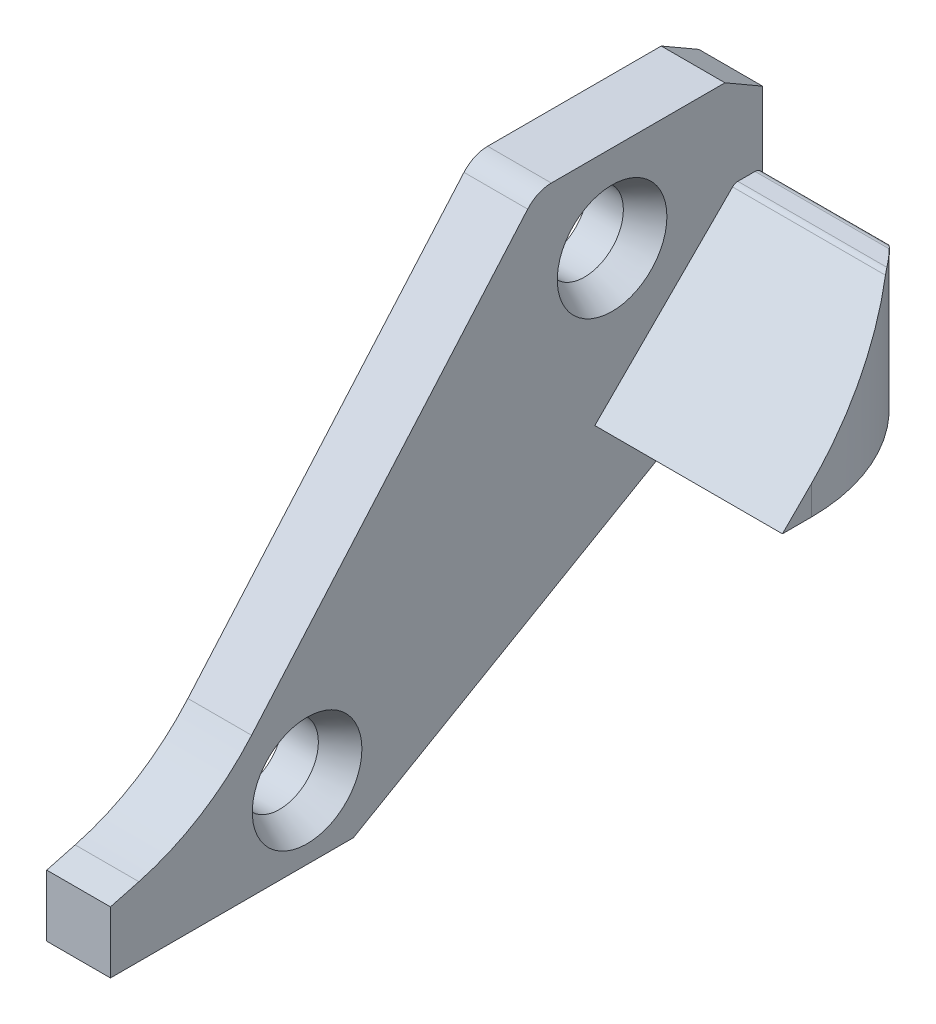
from build123d import *
from OCP.BRepFilletAPI import BRepFilletAPI_MakeChamfer

# Parameters (mm, degrees)
SKETCH_1_R          = 1.9685
EXTRUDE_1_DEPTH     = 3.2258
EXTRUDE_2_DEPTH     = 9.4996
CUT_EXTRUDE_1_REACH = 36.205
CHAMFER_1_SIZE      = 1.397
CHAMFER_1_SIZE2     = 0.806558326


with BuildPart() as part:
    # Sketch 1 → Extrude 1 (new body)
    with BuildSketch(Plane(origin=(0, 0, 0), x_dir=(0, 0, -1), z_dir=(1, 0, 0))):
        with BuildLine():
            Line((-25.4, -19.304), (-25.4, -16.185235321))
            Line((-25.4, -16.185235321), (-23.960679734, -15.799570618))
            ThreePointArc((-23.960679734, -15.799570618), (-20.840485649, -14.442871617), (-18.253289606, -12.233197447))
            Line((-18.253289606, -12.233197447), (-4.273949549, 3.848193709))
            ThreePointArc((-4.273949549, 3.848193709), (-3.734173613, 4.251263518), (-3.07584809, 4.3942))
            Line((-3.07584809, 4.3942), (5.715, 4.3942))
            Line((5.715, 4.3942), (7.62, 3.294347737))
            Line((7.62, 3.294347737), (7.62, -7.3406))
            Line((7.62, -7.3406), (-13.101216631, -19.304))
            Line((-13.101216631, -19.304), (-25.4, -19.304))
        make_face()
        Circle(SKETCH_1_R, mode=Mode.SUBTRACT)
        with Locations((-15.4432, -15.621)):
            Circle(SKETCH_1_R, mode=Mode.SUBTRACT)
    extrude(amount=EXTRUDE_1_DEPTH)

    # Sketch 2 → Extrude 2 (add)
    with BuildSketch(Plane(origin=(3.2258, 0, 0), x_dir=(0, 0, -1), z_dir=(1, 0, 0))):
        with BuildLine():
            Line((7.62, -7.3406), (7.62, -0.635))
            ThreePointArc((7.62, -0.635), (7.508407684, -0.365592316), (7.239, -0.254))
            Line((7.239, -0.254), (6.369599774, -0.254))
            ThreePointArc((6.369599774, -0.254), (6.223797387, -0.283001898), (6.100192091, -0.365592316))
            Line((6.100192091, -0.365592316), (-0.874815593, -7.3406))
            Line((-0.874815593, -7.3406), (7.62, -7.3406))
        make_face()
    extrude(amount=EXTRUDE_2_DEPTH)

    # Cut-Extrude 1: up to this face of the body (flat: up to its plane)
    cut_extrude_1_end = Plane(part.part.faces().sort_by_distance((7.9756, -7.3406, -3.372592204))[0])
    # Sketch 3 → Cut-Extrude 1 (cut, up to the picked face)
    with BuildSketch(Plane(origin=(0, -0.254, 0), x_dir=(1, 0, 0), z_dir=(0, 1, 0)), mode=Mode.PRIVATE) as cut_extrude_1_sk1:
        with BuildLine():
            Line((12.7254, 0.589382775), (12.7254, 7.62))
            Line((12.7254, 7.62), (9.6266, 7.62))
            ThreePointArc((9.6266, 7.62), (11.916338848, 4.431001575), (12.7254, 0.589382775))
        make_face()
    cut_extrude_1_tool1 = split(extrude(cut_extrude_1_sk1.sketch, amount=-CUT_EXTRUDE_1_REACH, mode=Mode.PRIVATE), bisect_by=cut_extrude_1_end, keep=Keep.BOTH, mode=Mode.PRIVATE)
    add(cut_extrude_1_tool1.solids().sort_by(Axis((11.829003, -0.254, -5.924658), (0, -1, 0)))[0], mode=Mode.SUBTRACT)

    # Chamfer 1: one chamfer whose edges measure the first distance from different faces: ONE call of the kernel's chamfer builder (chamfer() names one face for all edges)
    chamfer_1_edges_1 = [part.edges().sort_by_distance(p)[0] for p in [
        (3.2258, 0, 1.9685),
    ]]
    chamfer_1_side_1 = [part.faces().sort_by_distance(p)[0] for p in [
        (1.6129, 0, 1.9685),
    ]]
    chamfer_1_edges_2 = [part.edges().sort_by_distance(p)[0] for p in [
        (3.2258, -15.621, 17.4117),
    ]]
    chamfer_1_side_2 = [part.faces().sort_by_distance(p)[0] for p in [
        (1.6129, -15.621, 17.4117),
    ]]
    chamfer_1 = BRepFilletAPI_MakeChamfer(part.part.solid().wrapped)
    for e in chamfer_1_edges_1:
        chamfer_1.Add(CHAMFER_1_SIZE, CHAMFER_1_SIZE2, e.wrapped, chamfer_1_side_1[0].wrapped)  # the first distance lies on this face
    for e in chamfer_1_edges_2:
        chamfer_1.Add(CHAMFER_1_SIZE, CHAMFER_1_SIZE2, e.wrapped, chamfer_1_side_2[0].wrapped)  # the first distance lies on this face
    add(Compound.cast(chamfer_1.Shape()), mode=Mode.REPLACE)


solid = part.part
